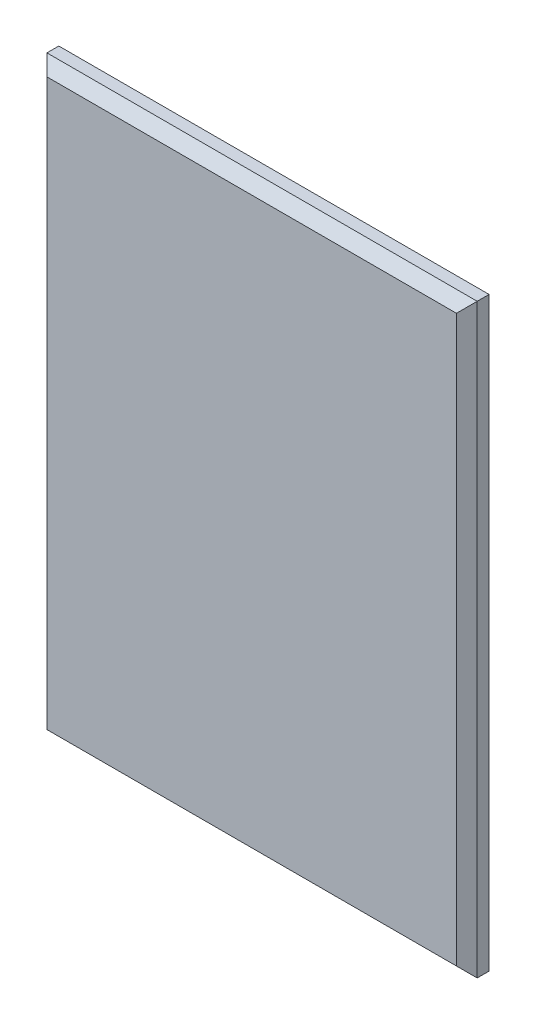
from build123d import *

# Parameters (mm, degrees)
SKETCH1_W           = 368.3
SKETCH1_H           = 501.65
BOSS_EXTRUDE1_DEPTH = 19.05
CHAMFER1_SIZE       = 8.89


with BuildPart() as part:
    # Sketch1 → Boss-Extrude1 (new body)
    with BuildSketch(Plane.XY):
        with Locations((184.15, 250.825)):
            Rectangle(SKETCH1_W, SKETCH1_H)
    extrude(amount=BOSS_EXTRUDE1_DEPTH)

    # Chamfer1
    chamfer1_edges = [part.edges().sort_by_distance(p)[0] for p in [
        (368.3, 250.825, 19.05),
        (184.15, 501.65, 19.05),
        (0, 250.825, 19.05),
        (184.15, 0, 19.05),
    ]]
    chamfer(chamfer1_edges, length=CHAMFER1_SIZE)


solid = part.part
